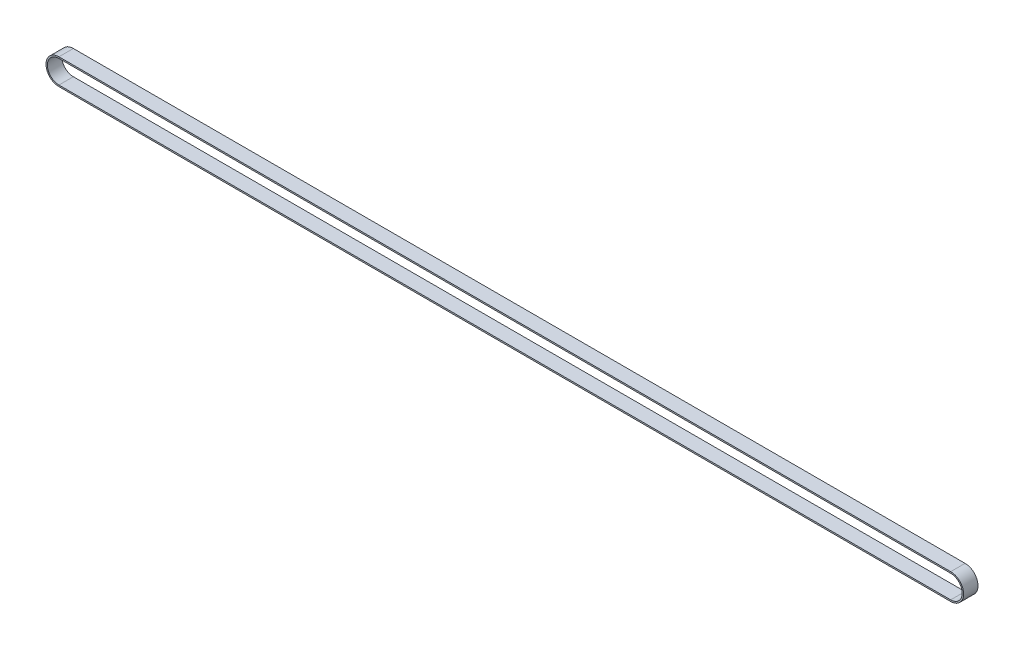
from build123d import *

# Parameters (mm, degrees)
EXTRU_MINCE1_DEPTH = 5


with BuildPart() as part:
    # Esquisse1 → Extru.-Mince1 (new body)
    with BuildSketch(Plane.XY):
        with BuildLine():
            Line((310, -4.5), (0, -4.5))
            ThreePointArc((0, -4.5), (-4.5, 0), (0, 4.5))
            Line((0, 4.5), (310, 4.5))
            ThreePointArc((310, 4.5), (314.5, 0), (310, -4.5))
        make_face()
        with BuildLine():
            Line((310, -4), (0, -4))
            ThreePointArc((0, -4), (-4, 0), (0, 4))
            Line((0, 4), (310, 4))
            ThreePointArc((310, 4), (314, 0), (310, -4))
        make_face(mode=Mode.SUBTRACT)
    extrude(amount=EXTRU_MINCE1_DEPTH)


solid = part.part
